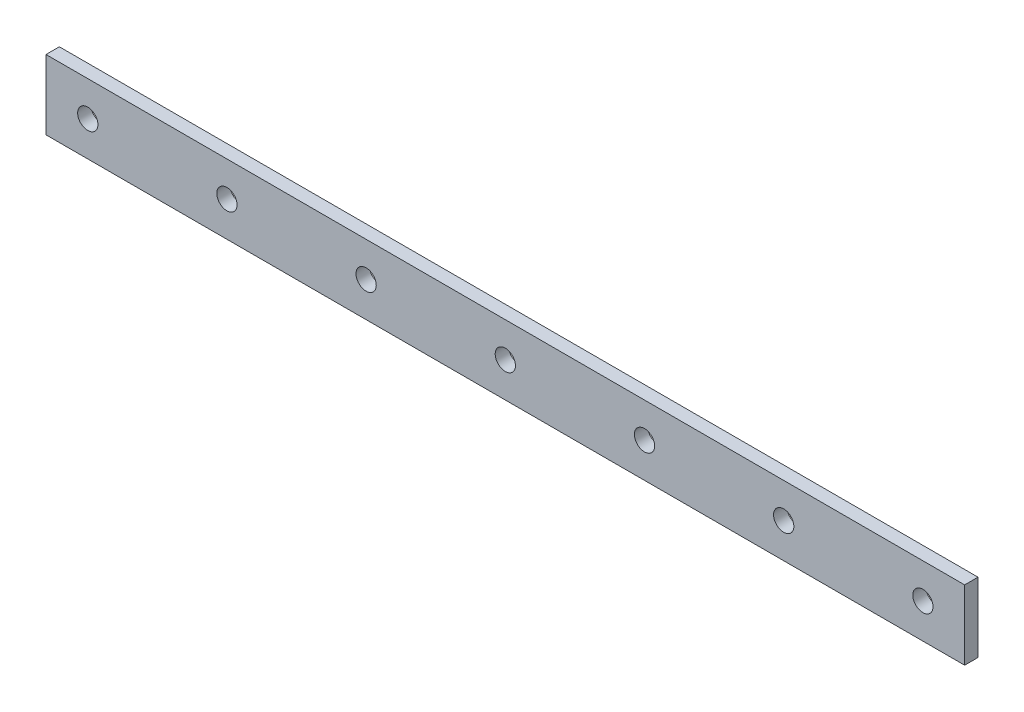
from build123d import *

# Parameters (mm, degrees)
SKETCH1_W           = 104.775
SKETCH1_H           = 7.9375
BOSS_EXTRUDE1_DEPTH = 1.524
SKETCH2_R           = 1.1557
CUT_EXTRUDE1_DEPTH  = 53.559715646
LPATTERN1_COUNT     = 4
LPATTERN1_PITCH     = 15.875
LPATTERN1_COL_COUNT = 4
LPATTERN1_COL_PITCH = 15.875


with BuildPart() as part:
    # Sketch1 → Boss-Extrude1 (new body)
    with BuildSketch(Plane.XY):
        Rectangle(SKETCH1_W, SKETCH1_H)
    extrude(amount=BOSS_EXTRUDE1_DEPTH)

    # Sketch2 → Cut-Extrude1 (cut, through all)
    with BuildSketch(Plane.XY.offset(1.524)):
        Circle(SKETCH2_R)
    cut_extrude1 = extrude(amount=-CUT_EXTRUDE1_DEPTH, mode=Mode.SUBTRACT)

    # LPattern1: Cut-Extrude1 ×4
    with Locations(*[(i * LPATTERN1_PITCH, 0, 0) for i in range(1, LPATTERN1_COUNT)]):
        add(cut_extrude1, mode=Mode.SUBTRACT)

    # LPattern1 col: Cut-Extrude1 ×4
    with Locations(*[(-i * LPATTERN1_COL_PITCH, 0, 0) for i in range(1, LPATTERN1_COL_COUNT)]):
        add(cut_extrude1, mode=Mode.SUBTRACT)


solid = part.part
